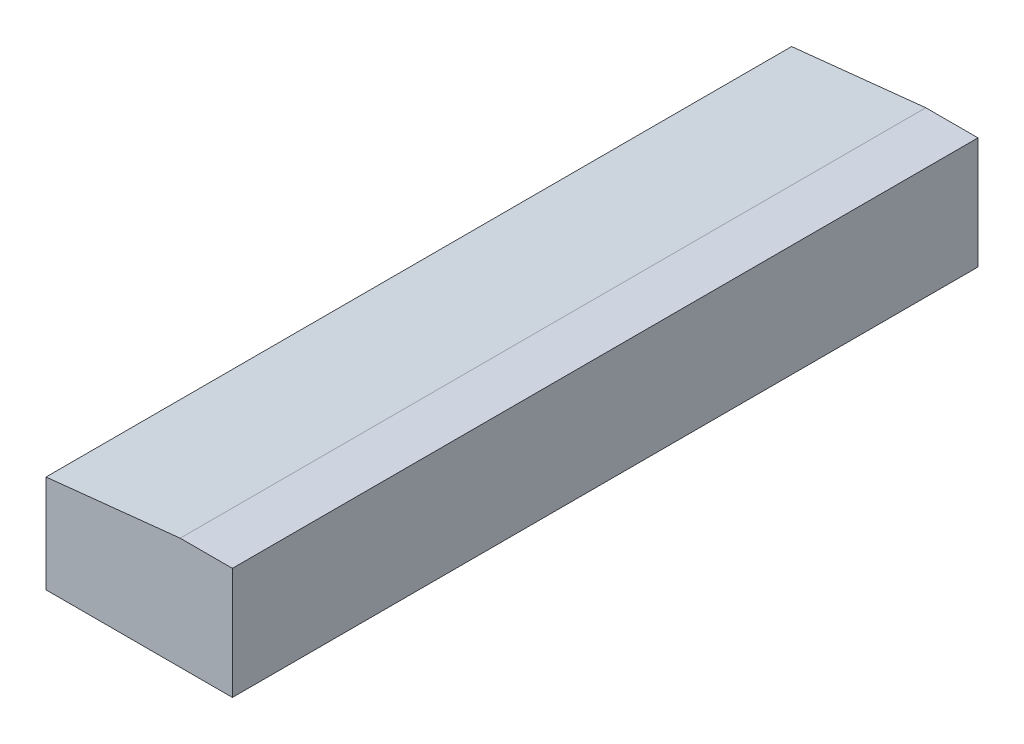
ISO-10303-21;
HEADER;
FILE_DESCRIPTION(('STEP AP214'),'2;1');
FILE_NAME('part.step','',(''),(''),'','','');
FILE_SCHEMA(('AUTOMOTIVE_DESIGN { 1 0 10303 214 1 1 1 1 }'));
ENDSEC;
DATA;
#1=APPLICATION_CONTEXT('core data for automotive mechanical design processes');
#2=APPLICATION_PROTOCOL_DEFINITION('international standard','automotive_design',2000,#1);
#3=PRODUCT_CONTEXT('',#1,'mechanical');
#4=PRODUCT('Part','Part','',(#3));
#5=PRODUCT_RELATED_PRODUCT_CATEGORY('part','',(#4));
#6=PRODUCT_DEFINITION_FORMATION('','',#4);
#7=PRODUCT_DEFINITION_CONTEXT('part definition',#1,'design');
#8=PRODUCT_DEFINITION('design','',#6,#7);
#9=PRODUCT_DEFINITION_SHAPE('','',#8);
#10=(LENGTH_UNIT() NAMED_UNIT(*) SI_UNIT(.MILLI.,.METRE.));
#11=(NAMED_UNIT(*) PLANE_ANGLE_UNIT() SI_UNIT($,.RADIAN.));
#12=(NAMED_UNIT(*) SI_UNIT($,.STERADIAN.) SOLID_ANGLE_UNIT());
#13=UNCERTAINTY_MEASURE_WITH_UNIT(LENGTH_MEASURE(1.E-05),#10,'distance_accuracy_value','');
#14=(GEOMETRIC_REPRESENTATION_CONTEXT(3) GLOBAL_UNCERTAINTY_ASSIGNED_CONTEXT((#13)) GLOBAL_UNIT_ASSIGNED_CONTEXT((#10,
#11,#12)) REPRESENTATION_CONTEXT('',''));
#15=CARTESIAN_POINT('',(0.,0.,0.));
#16=DIRECTION('',(0.,0.,1.));
#17=DIRECTION('',(1.,0.,0.));
#18=AXIS2_PLACEMENT_3D('',#15,#16,#17);
#19=CARTESIAN_POINT('',(0.,0.,100.));
#20=DIRECTION('',(1.,0.,0.));
#21=DIRECTION('',(0.,0.,-1.));
#22=AXIS2_PLACEMENT_3D('',#19,#20,#21);
#23=PLANE('',#22);
#24=DIRECTION('',(0.,-1.,0.));
#25=VECTOR('',#24,1.);
#26=CARTESIAN_POINT('',(0.,0.,0.));
#27=LINE('',#26,#25);
#28=CARTESIAN_POINT('',(0.,13.1081237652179,0.));
#29=VERTEX_POINT('',#28);
#30=CARTESIAN_POINT('',(0.,0.,0.));
#31=VERTEX_POINT('',#30);
#32=EDGE_CURVE('E76',#29,#31,#27,.T.);
#33=ORIENTED_EDGE('',*,*,#32,.T.);
#34=DIRECTION('',(0.,0.,-1.));
#35=VECTOR('',#34,1.);
#36=CARTESIAN_POINT('',(0.,0.,100.));
#37=LINE('',#36,#35);
#38=CARTESIAN_POINT('',(0.,0.,100.));
#39=VERTEX_POINT('',#38);
#40=EDGE_CURVE('E11',#39,#31,#37,.T.);
#41=ORIENTED_EDGE('',*,*,#40,.F.);
#42=DIRECTION('',(0.,-1.,0.));
#43=VECTOR('',#42,1.);
#44=CARTESIAN_POINT('',(0.,0.,100.));
#45=LINE('',#44,#43);
#46=CARTESIAN_POINT('',(0.,13.1081237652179,100.));
#47=VERTEX_POINT('',#46);
#48=EDGE_CURVE('E97',#47,#39,#45,.T.);
#49=ORIENTED_EDGE('',*,*,#48,.F.);
#50=DIRECTION('',(0.,0.,-1.));
#51=VECTOR('',#50,1.);
#52=CARTESIAN_POINT('',(0.,13.1081237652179,100.));
#53=LINE('',#52,#51);
#54=EDGE_CURVE('E89',#47,#29,#53,.T.);
#55=ORIENTED_EDGE('',*,*,#54,.T.);
#56=EDGE_LOOP('',(#33,#41,#49,#55));
#57=FACE_BOUND('',#56,.T.);
#58=ADVANCED_FACE('F26',(#57),#23,.F.);
#59=CARTESIAN_POINT('',(25.,0.,100.));
#60=DIRECTION('',(0.,1.,0.));
#61=DIRECTION('',(0.,0.,1.));
#62=AXIS2_PLACEMENT_3D('',#59,#60,#61);
#63=PLANE('',#62);
#64=DIRECTION('',(1.,0.,0.));
#65=VECTOR('',#64,1.);
#66=CARTESIAN_POINT('',(25.,0.,0.));
#67=LINE('',#66,#65);
#68=CARTESIAN_POINT('',(25.,0.,0.));
#69=VERTEX_POINT('',#68);
#70=EDGE_CURVE('E72',#31,#69,#67,.T.);
#71=ORIENTED_EDGE('',*,*,#70,.T.);
#72=DIRECTION('',(0.,0.,-1.));
#73=VECTOR('',#72,1.);
#74=CARTESIAN_POINT('',(25.,0.,100.));
#75=LINE('',#74,#73);
#76=CARTESIAN_POINT('',(25.,0.,100.));
#77=VERTEX_POINT('',#76);
#78=EDGE_CURVE('E33',#77,#69,#75,.T.);
#79=ORIENTED_EDGE('',*,*,#78,.F.);
#80=DIRECTION('',(1.,0.,0.));
#81=VECTOR('',#80,1.);
#82=CARTESIAN_POINT('',(25.,0.,100.));
#83=LINE('',#82,#81);
#84=EDGE_CURVE('E85',#39,#77,#83,.T.);
#85=ORIENTED_EDGE('',*,*,#84,.F.);
#86=ORIENTED_EDGE('',*,*,#40,.T.);
#87=EDGE_LOOP('',(#71,#79,#85,#86));
#88=FACE_BOUND('',#87,.T.);
#89=ADVANCED_FACE('F84',(#88),#63,.F.);
#90=CARTESIAN_POINT('',(25.,15.,100.));
#91=DIRECTION('',(-1.,0.,0.));
#92=DIRECTION('',(0.,0.,1.));
#93=AXIS2_PLACEMENT_3D('',#90,#91,#92);
#94=PLANE('',#93);
#95=DIRECTION('',(0.,1.,0.));
#96=VECTOR('',#95,1.);
#97=CARTESIAN_POINT('',(25.,15.,0.));
#98=LINE('',#97,#96);
#99=CARTESIAN_POINT('',(25.,15.,0.));
#100=VERTEX_POINT('',#99);
#101=EDGE_CURVE('E78',#69,#100,#98,.T.);
#102=ORIENTED_EDGE('',*,*,#101,.T.);
#103=DIRECTION('',(0.,0.,-1.));
#104=VECTOR('',#103,1.);
#105=CARTESIAN_POINT('',(25.,15.,100.));
#106=LINE('',#105,#104);
#107=CARTESIAN_POINT('',(25.,15.,100.));
#108=VERTEX_POINT('',#107);
#109=EDGE_CURVE('E108',#108,#100,#106,.T.);
#110=ORIENTED_EDGE('',*,*,#109,.F.);
#111=DIRECTION('',(0.,1.,0.));
#112=VECTOR('',#111,1.);
#113=CARTESIAN_POINT('',(25.,15.,100.));
#114=LINE('',#113,#112);
#115=EDGE_CURVE('E100',#77,#108,#114,.T.);
#116=ORIENTED_EDGE('',*,*,#115,.F.);
#117=ORIENTED_EDGE('',*,*,#78,.T.);
#118=EDGE_LOOP('',(#102,#110,#116,#117));
#119=FACE_BOUND('',#118,.T.);
#120=ADVANCED_FACE('F112',(#119),#94,.F.);
#121=CARTESIAN_POINT('',(18.,15.,100.));
#122=DIRECTION('',(0.,-1.,0.));
#123=DIRECTION('',(1.,0.,0.));
#124=AXIS2_PLACEMENT_3D('',#121,#122,#123);
#125=PLANE('',#124);
#126=DIRECTION('',(-1.,0.,0.));
#127=VECTOR('',#126,1.);
#128=CARTESIAN_POINT('',(18.,15.,0.));
#129=LINE('',#128,#127);
#130=CARTESIAN_POINT('',(18.,15.,0.));
#131=VERTEX_POINT('',#130);
#132=EDGE_CURVE('E93',#100,#131,#129,.T.);
#133=ORIENTED_EDGE('',*,*,#132,.T.);
#134=DIRECTION('',(0.,0.,-1.));
#135=VECTOR('',#134,1.);
#136=CARTESIAN_POINT('',(18.,15.,100.));
#137=LINE('',#136,#135);
#138=CARTESIAN_POINT('',(18.,15.,100.));
#139=VERTEX_POINT('',#138);
#140=EDGE_CURVE('E105',#139,#131,#137,.T.);
#141=ORIENTED_EDGE('',*,*,#140,.F.);
#142=DIRECTION('',(-1.,0.,0.));
#143=VECTOR('',#142,1.);
#144=CARTESIAN_POINT('',(18.,15.,100.));
#145=LINE('',#144,#143);
#146=EDGE_CURVE('E45',#108,#139,#145,.T.);
#147=ORIENTED_EDGE('',*,*,#146,.F.);
#148=ORIENTED_EDGE('',*,*,#109,.T.);
#149=EDGE_LOOP('',(#133,#141,#147,#148));
#150=FACE_BOUND('',#149,.T.);
#151=ADVANCED_FACE('F123',(#150),#125,.F.);
#152=CARTESIAN_POINT('',(0.,13.1081237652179,100.));
#153=DIRECTION('',(0.104528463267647,-0.994521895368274,0.));
#154=DIRECTION('',(0.994521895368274,0.104528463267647,0.));
#155=AXIS2_PLACEMENT_3D('',#152,#153,#154);
#156=PLANE('',#155);
#157=DIRECTION('',(-0.994521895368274,-0.104528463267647,0.));
#158=VECTOR('',#157,1.);
#159=CARTESIAN_POINT('',(0.,13.1081237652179,0.));
#160=LINE('',#159,#158);
#161=EDGE_CURVE('E95',#131,#29,#160,.T.);
#162=ORIENTED_EDGE('',*,*,#161,.T.);
#163=ORIENTED_EDGE('',*,*,#54,.F.);
#164=DIRECTION('',(-0.994521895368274,-0.104528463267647,0.));
#165=VECTOR('',#164,1.);
#166=CARTESIAN_POINT('',(0.,13.1081237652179,100.));
#167=LINE('',#166,#165);
#168=EDGE_CURVE('E40',#139,#47,#167,.T.);
#169=ORIENTED_EDGE('',*,*,#168,.F.);
#170=ORIENTED_EDGE('',*,*,#140,.T.);
#171=EDGE_LOOP('',(#162,#163,#169,#170));
#172=FACE_BOUND('',#171,.T.);
#173=ADVANCED_FACE('F116',(#172),#156,.F.);
#174=CARTESIAN_POINT('',(0.,0.,100.));
#175=DIRECTION('',(0.,0.,1.));
#176=DIRECTION('',(1.,0.,0.));
#177=AXIS2_PLACEMENT_3D('',#174,#175,#176);
#178=PLANE('',#177);
#179=ORIENTED_EDGE('',*,*,#48,.T.);
#180=ORIENTED_EDGE('',*,*,#84,.T.);
#181=ORIENTED_EDGE('',*,*,#115,.T.);
#182=ORIENTED_EDGE('',*,*,#146,.T.);
#183=ORIENTED_EDGE('',*,*,#168,.T.);
#184=EDGE_LOOP('',(#179,#180,#181,#182,#183));
#185=FACE_BOUND('',#184,.T.);
#186=ADVANCED_FACE('F114',(#185),#178,.T.);
#187=CARTESIAN_POINT('',(0.,0.,0.));
#188=DIRECTION('',(0.,0.,1.));
#189=DIRECTION('',(1.,0.,0.));
#190=AXIS2_PLACEMENT_3D('',#187,#188,#189);
#191=PLANE('',#190);
#192=ORIENTED_EDGE('',*,*,#32,.F.);
#193=ORIENTED_EDGE('',*,*,#161,.F.);
#194=ORIENTED_EDGE('',*,*,#132,.F.);
#195=ORIENTED_EDGE('',*,*,#101,.F.);
#196=ORIENTED_EDGE('',*,*,#70,.F.);
#197=EDGE_LOOP('',(#192,#193,#194,#195,#196));
#198=FACE_BOUND('',#197,.T.);
#199=ADVANCED_FACE('F73',(#198),#191,.F.);
#200=CLOSED_SHELL('',(#58,#89,#120,#151,#173,#186,#199));
#201=MANIFOLD_SOLID_BREP('B2',#200);
#202=ADVANCED_BREP_SHAPE_REPRESENTATION('',(#18,#201),#14);
#203=SHAPE_DEFINITION_REPRESENTATION(#9,#202);
ENDSEC;
END-ISO-10303-21;
